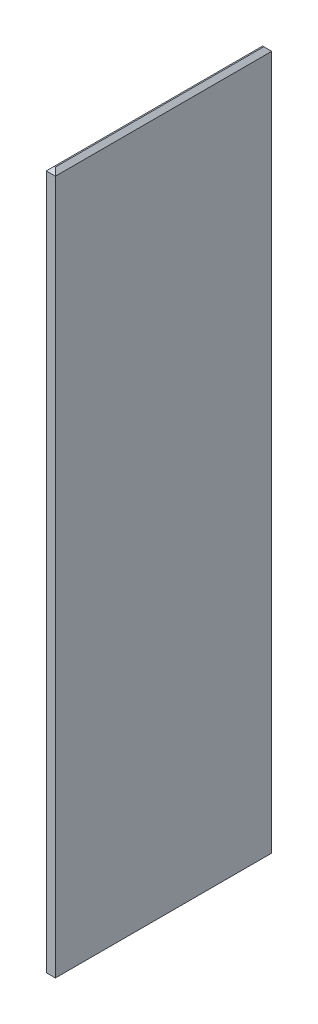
ISO-10303-21;
HEADER;
FILE_DESCRIPTION(('STEP AP214'),'2;1');
FILE_NAME('part.step','',(''),(''),'','','');
FILE_SCHEMA(('AUTOMOTIVE_DESIGN { 1 0 10303 214 1 1 1 1 }'));
ENDSEC;
DATA;
#1=APPLICATION_CONTEXT('core data for automotive mechanical design processes');
#2=APPLICATION_PROTOCOL_DEFINITION('international standard','automotive_design',2000,#1);
#3=PRODUCT_CONTEXT('',#1,'mechanical');
#4=PRODUCT('Part','Part','',(#3));
#5=PRODUCT_RELATED_PRODUCT_CATEGORY('part','',(#4));
#6=PRODUCT_DEFINITION_FORMATION('','',#4);
#7=PRODUCT_DEFINITION_CONTEXT('part definition',#1,'design');
#8=PRODUCT_DEFINITION('design','',#6,#7);
#9=PRODUCT_DEFINITION_SHAPE('','',#8);
#10=(LENGTH_UNIT() NAMED_UNIT(*) SI_UNIT(.MILLI.,.METRE.));
#11=(NAMED_UNIT(*) PLANE_ANGLE_UNIT() SI_UNIT($,.RADIAN.));
#12=(NAMED_UNIT(*) SI_UNIT($,.STERADIAN.) SOLID_ANGLE_UNIT());
#13=UNCERTAINTY_MEASURE_WITH_UNIT(LENGTH_MEASURE(1.E-05),#10,'distance_accuracy_value','');
#14=(GEOMETRIC_REPRESENTATION_CONTEXT(3) GLOBAL_UNCERTAINTY_ASSIGNED_CONTEXT((#13)) GLOBAL_UNIT_ASSIGNED_CONTEXT((#10,
#11,#12)) REPRESENTATION_CONTEXT('',''));
#15=CARTESIAN_POINT('',(0.,0.,0.));
#16=DIRECTION('',(0.,0.,1.));
#17=DIRECTION('',(1.,0.,0.));
#18=AXIS2_PLACEMENT_3D('',#15,#16,#17);
#19=CARTESIAN_POINT('',(-63.4999999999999,9739.6,1500.));
#20=DIRECTION('',(1.,0.,0.));
#21=DIRECTION('',(0.,0.,-1.));
#22=AXIS2_PLACEMENT_3D('',#19,#20,#21);
#23=PLANE('',#22);
#24=DIRECTION('',(0.,-1.,0.));
#25=VECTOR('',#24,1.);
#26=CARTESIAN_POINT('',(-63.5000000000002,9739.6,-1500.));
#27=LINE('',#26,#25);
#28=CARTESIAN_POINT('',(-63.5000000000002,9684.6,-1500.));
#29=VERTEX_POINT('',#28);
#30=CARTESIAN_POINT('',(-63.5000000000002,54.9999999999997,-1500.));
#31=VERTEX_POINT('',#30);
#32=EDGE_CURVE('E154',#29,#31,#27,.T.);
#33=ORIENTED_EDGE('',*,*,#32,.T.);
#34=DIRECTION('',(0.,0.,1.));
#35=VECTOR('',#34,1.);
#36=CARTESIAN_POINT('',(-63.4999999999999,54.9999999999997,1500.));
#37=LINE('',#36,#35);
#38=CARTESIAN_POINT('',(-63.4999999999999,54.9999999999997,1500.));
#39=VERTEX_POINT('',#38);
#40=EDGE_CURVE('E163',#31,#39,#37,.T.);
#41=ORIENTED_EDGE('',*,*,#40,.T.);
#42=DIRECTION('',(0.,-1.,0.));
#43=VECTOR('',#42,1.);
#44=CARTESIAN_POINT('',(-63.4999999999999,9739.6,1500.));
#45=LINE('',#44,#43);
#46=CARTESIAN_POINT('',(-63.4999999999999,9684.6,1500.));
#47=VERTEX_POINT('',#46);
#48=EDGE_CURVE('E133',#47,#39,#45,.T.);
#49=ORIENTED_EDGE('',*,*,#48,.F.);
#50=DIRECTION('',(0.,0.,-1.));
#51=VECTOR('',#50,1.);
#52=CARTESIAN_POINT('',(-63.5000000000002,9684.6,-1500.));
#53=LINE('',#52,#51);
#54=EDGE_CURVE('E167',#47,#29,#53,.T.);
#55=ORIENTED_EDGE('',*,*,#54,.T.);
#56=EDGE_LOOP('',(#33,#41,#49,#55));
#57=FACE_BOUND('',#56,.T.);
#58=ADVANCED_FACE('F44',(#57),#23,.F.);
#59=CARTESIAN_POINT('',(63.5000000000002,9739.6,1500.));
#60=DIRECTION('',(0.,0.,-1.));
#61=DIRECTION('',(-1.,0.,0.));
#62=AXIS2_PLACEMENT_3D('',#59,#60,#61);
#63=PLANE('',#62);
#64=ORIENTED_EDGE('',*,*,#48,.T.);
#65=DIRECTION('',(1.,0.,0.));
#66=VECTOR('',#65,1.);
#67=CARTESIAN_POINT('',(63.5000000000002,54.9999999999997,1500.));
#68=LINE('',#67,#66);
#69=CARTESIAN_POINT('',(63.5000000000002,54.9999999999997,1500.));
#70=VERTEX_POINT('',#69);
#71=EDGE_CURVE('E135',#39,#70,#68,.T.);
#72=ORIENTED_EDGE('',*,*,#71,.T.);
#73=DIRECTION('',(0.,-1.,0.));
#74=VECTOR('',#73,1.);
#75=CARTESIAN_POINT('',(63.5000000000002,9739.6,1500.));
#76=LINE('',#75,#74);
#77=CARTESIAN_POINT('',(63.5000000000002,9684.6,1500.));
#78=VERTEX_POINT('',#77);
#79=EDGE_CURVE('E113',#78,#70,#76,.T.);
#80=ORIENTED_EDGE('',*,*,#79,.F.);
#81=DIRECTION('',(-1.,0.,0.));
#82=VECTOR('',#81,1.);
#83=CARTESIAN_POINT('',(-63.4999999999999,9684.6,1500.));
#84=LINE('',#83,#82);
#85=EDGE_CURVE('E129',#78,#47,#84,.T.);
#86=ORIENTED_EDGE('',*,*,#85,.T.);
#87=EDGE_LOOP('',(#64,#72,#80,#86));
#88=FACE_BOUND('',#87,.T.);
#89=ADVANCED_FACE('F126',(#88),#63,.F.);
#90=CARTESIAN_POINT('',(63.5000000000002,9739.6,1500.));
#91=DIRECTION('',(-1.,0.,0.));
#92=DIRECTION('',(0.,0.,1.));
#93=AXIS2_PLACEMENT_3D('',#90,#91,#92);
#94=PLANE('',#93);
#95=ORIENTED_EDGE('',*,*,#79,.T.);
#96=DIRECTION('',(0.,0.,-1.));
#97=VECTOR('',#96,1.);
#98=CARTESIAN_POINT('',(63.5000000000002,54.9999999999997,1500.));
#99=LINE('',#98,#97);
#100=CARTESIAN_POINT('',(63.4999999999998,54.9999999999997,-1500.));
#101=VERTEX_POINT('',#100);
#102=EDGE_CURVE('E123',#70,#101,#99,.T.);
#103=ORIENTED_EDGE('',*,*,#102,.T.);
#104=DIRECTION('',(0.,-1.,0.));
#105=VECTOR('',#104,1.);
#106=CARTESIAN_POINT('',(63.4999999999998,9739.6,-1500.));
#107=LINE('',#106,#105);
#108=CARTESIAN_POINT('',(63.4999999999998,9684.6,-1500.));
#109=VERTEX_POINT('',#108);
#110=EDGE_CURVE('E120',#109,#101,#107,.T.);
#111=ORIENTED_EDGE('',*,*,#110,.F.);
#112=DIRECTION('',(0.,0.,1.));
#113=VECTOR('',#112,1.);
#114=CARTESIAN_POINT('',(63.5000000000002,9684.6,1500.));
#115=LINE('',#114,#113);
#116=EDGE_CURVE('E115',#109,#78,#115,.T.);
#117=ORIENTED_EDGE('',*,*,#116,.T.);
#118=EDGE_LOOP('',(#95,#103,#111,#117));
#119=FACE_BOUND('',#118,.T.);
#120=ADVANCED_FACE('F111',(#119),#94,.F.);
#121=CARTESIAN_POINT('',(63.4999999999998,9739.6,-1500.));
#122=DIRECTION('',(0.,0.,1.));
#123=DIRECTION('',(1.,0.,0.));
#124=AXIS2_PLACEMENT_3D('',#121,#122,#123);
#125=PLANE('',#124);
#126=ORIENTED_EDGE('',*,*,#110,.T.);
#127=DIRECTION('',(-1.,0.,0.));
#128=VECTOR('',#127,1.);
#129=CARTESIAN_POINT('',(63.4999999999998,54.9999999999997,-1500.));
#130=LINE('',#129,#128);
#131=EDGE_CURVE('E169',#101,#31,#130,.T.);
#132=ORIENTED_EDGE('',*,*,#131,.T.);
#133=ORIENTED_EDGE('',*,*,#32,.F.);
#134=DIRECTION('',(1.,0.,0.));
#135=VECTOR('',#134,1.);
#136=CARTESIAN_POINT('',(63.4999999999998,9684.6,-1500.));
#137=LINE('',#136,#135);
#138=EDGE_CURVE('E168',#29,#109,#137,.T.);
#139=ORIENTED_EDGE('',*,*,#138,.T.);
#140=EDGE_LOOP('',(#126,#132,#133,#139));
#141=FACE_BOUND('',#140,.T.);
#142=ADVANCED_FACE('F208',(#141),#125,.F.);
#143=CARTESIAN_POINT('',(0.,9739.6,0.));
#144=DIRECTION('',(0.,1.,0.));
#145=DIRECTION('',(0.,0.,1.));
#146=AXIS2_PLACEMENT_3D('',#143,#144,#145);
#147=PLANE('',#146);
#148=DIRECTION('',(0.,0.,-1.));
#149=VECTOR('',#148,1.);
#150=CARTESIAN_POINT('',(8.50000000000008,9739.6,-1500.));
#151=LINE('',#150,#149);
#152=CARTESIAN_POINT('',(8.50000000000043,9739.6,1445.));
#153=VERTEX_POINT('',#152);
#154=CARTESIAN_POINT('',(8.50000000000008,9739.6,-1445.));
#155=VERTEX_POINT('',#154);
#156=EDGE_CURVE('E54',#153,#155,#151,.T.);
#157=ORIENTED_EDGE('',*,*,#156,.T.);
#158=DIRECTION('',(-1.,0.,0.));
#159=VECTOR('',#158,1.);
#160=CARTESIAN_POINT('',(-63.5000000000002,9739.6,-1445.));
#161=LINE('',#160,#159);
#162=CARTESIAN_POINT('',(-8.50000000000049,9739.6,-1445.));
#163=VERTEX_POINT('',#162);
#164=EDGE_CURVE('E11',#155,#163,#161,.T.);
#165=ORIENTED_EDGE('',*,*,#164,.T.);
#166=DIRECTION('',(0.,0.,1.));
#167=VECTOR('',#166,1.);
#168=CARTESIAN_POINT('',(-8.50000000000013,9739.6,1500.));
#169=LINE('',#168,#167);
#170=CARTESIAN_POINT('',(-8.50000000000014,9739.6,1445.));
#171=VERTEX_POINT('',#170);
#172=EDGE_CURVE('E165',#163,#171,#169,.T.);
#173=ORIENTED_EDGE('',*,*,#172,.T.);
#174=DIRECTION('',(1.,0.,0.));
#175=VECTOR('',#174,1.);
#176=CARTESIAN_POINT('',(63.5000000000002,9739.6,1445.));
#177=LINE('',#176,#175);
#178=EDGE_CURVE('E68',#171,#153,#177,.T.);
#179=ORIENTED_EDGE('',*,*,#178,.T.);
#180=EDGE_LOOP('',(#157,#165,#173,#179));
#181=FACE_BOUND('',#180,.T.);
#182=ADVANCED_FACE('F212',(#181),#147,.T.);
#183=CARTESIAN_POINT('',(0.,0.,0.));
#184=DIRECTION('',(0.,1.,0.));
#185=DIRECTION('',(0.,0.,1.));
#186=AXIS2_PLACEMENT_3D('',#183,#184,#185);
#187=PLANE('',#186);
#188=DIRECTION('',(0.,0.,1.));
#189=VECTOR('',#188,1.);
#190=CARTESIAN_POINT('',(8.50000000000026,0.,0.));
#191=LINE('',#190,#189);
#192=CARTESIAN_POINT('',(8.50000000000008,0.,-1445.));
#193=VERTEX_POINT('',#192);
#194=CARTESIAN_POINT('',(8.50000000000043,0.,1445.));
#195=VERTEX_POINT('',#194);
#196=EDGE_CURVE('E171',#193,#195,#191,.T.);
#197=ORIENTED_EDGE('',*,*,#196,.T.);
#198=DIRECTION('',(-1.,0.,0.));
#199=VECTOR('',#198,1.);
#200=CARTESIAN_POINT('',(0.,0.,1445.));
#201=LINE('',#200,#199);
#202=CARTESIAN_POINT('',(-8.50000000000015,0.,1445.));
#203=VERTEX_POINT('',#202);
#204=EDGE_CURVE('E124',#195,#203,#201,.T.);
#205=ORIENTED_EDGE('',*,*,#204,.T.);
#206=DIRECTION('',(0.,0.,-1.));
#207=VECTOR('',#206,1.);
#208=CARTESIAN_POINT('',(-8.50000000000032,0.,0.));
#209=LINE('',#208,#207);
#210=CARTESIAN_POINT('',(-8.50000000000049,0.,-1445.));
#211=VERTEX_POINT('',#210);
#212=EDGE_CURVE('E180',#203,#211,#209,.T.);
#213=ORIENTED_EDGE('',*,*,#212,.T.);
#214=DIRECTION('',(1.,0.,0.));
#215=VECTOR('',#214,1.);
#216=CARTESIAN_POINT('',(0.,0.,-1445.));
#217=LINE('',#216,#215);
#218=EDGE_CURVE('E179',#211,#193,#217,.T.);
#219=ORIENTED_EDGE('',*,*,#218,.T.);
#220=EDGE_LOOP('',(#197,#205,#213,#219));
#221=FACE_BOUND('',#220,.T.);
#222=ADVANCED_FACE('F216',(#221),#187,.F.);
#223=CARTESIAN_POINT('',(63.4999999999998,54.9999999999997,-1500.));
#224=DIRECTION('',(0.,0.707106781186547,0.707106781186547));
#225=DIRECTION('',(-1.,0.,0.));
#226=AXIS2_PLACEMENT_3D('',#223,#224,#225);
#227=PLANE('',#226);
#228=DIRECTION('',(-0.577350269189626,-0.577350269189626,0.577350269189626));
#229=VECTOR('',#228,1.);
#230=CARTESIAN_POINT('',(63.4999999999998,54.9999999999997,-1500.));
#231=LINE('',#230,#229);
#232=EDGE_CURVE('E156',#193,#101,#231,.F.);
#233=ORIENTED_EDGE('',*,*,#232,.F.);
#234=ORIENTED_EDGE('',*,*,#218,.F.);
#235=DIRECTION('',(0.577350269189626,-0.577350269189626,0.577350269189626));
#236=VECTOR('',#235,1.);
#237=CARTESIAN_POINT('',(936.5,-945.,-500.));
#238=LINE('',#237,#236);
#239=EDGE_CURVE('E155',#31,#211,#238,.T.);
#240=ORIENTED_EDGE('',*,*,#239,.F.);
#241=ORIENTED_EDGE('',*,*,#131,.F.);
#242=EDGE_LOOP('',(#233,#234,#240,#241));
#243=FACE_BOUND('',#242,.T.);
#244=ADVANCED_FACE('F191',(#243),#227,.F.);
#245=CARTESIAN_POINT('',(-63.4999999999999,54.9999999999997,1500.));
#246=DIRECTION('',(0.707106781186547,0.707106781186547,0.));
#247=DIRECTION('',(0.,0.,1.));
#248=AXIS2_PLACEMENT_3D('',#245,#246,#247);
#249=PLANE('',#248);
#250=ORIENTED_EDGE('',*,*,#239,.T.);
#251=ORIENTED_EDGE('',*,*,#212,.F.);
#252=DIRECTION('',(-0.577350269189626,0.577350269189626,0.577350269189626));
#253=VECTOR('',#252,1.);
#254=CARTESIAN_POINT('',(-63.4999999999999,54.9999999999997,1500.));
#255=LINE('',#254,#253);
#256=EDGE_CURVE('E141',#39,#203,#255,.F.);
#257=ORIENTED_EDGE('',*,*,#256,.F.);
#258=ORIENTED_EDGE('',*,*,#40,.F.);
#259=EDGE_LOOP('',(#250,#251,#257,#258));
#260=FACE_BOUND('',#259,.T.);
#261=ADVANCED_FACE('F200',(#260),#249,.F.);
#262=CARTESIAN_POINT('',(63.5000000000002,54.9999999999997,1500.));
#263=DIRECTION('',(-0.707106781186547,0.707106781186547,0.));
#264=DIRECTION('',(0.,0.,-1.));
#265=AXIS2_PLACEMENT_3D('',#262,#263,#264);
#266=PLANE('',#265);
#267=ORIENTED_EDGE('',*,*,#232,.T.);
#268=ORIENTED_EDGE('',*,*,#102,.F.);
#269=DIRECTION('',(-0.577350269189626,-0.577350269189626,-0.577350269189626));
#270=VECTOR('',#269,1.);
#271=CARTESIAN_POINT('',(63.5000000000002,54.9999999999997,1500.));
#272=LINE('',#271,#270);
#273=EDGE_CURVE('E142',#195,#70,#272,.F.);
#274=ORIENTED_EDGE('',*,*,#273,.F.);
#275=ORIENTED_EDGE('',*,*,#196,.F.);
#276=EDGE_LOOP('',(#267,#268,#274,#275));
#277=FACE_BOUND('',#276,.T.);
#278=ADVANCED_FACE('F210',(#277),#266,.F.);
#279=CARTESIAN_POINT('',(63.5000000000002,54.9999999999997,1500.));
#280=DIRECTION('',(0.,0.707106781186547,-0.707106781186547));
#281=DIRECTION('',(1.,0.,0.));
#282=AXIS2_PLACEMENT_3D('',#279,#280,#281);
#283=PLANE('',#282);
#284=ORIENTED_EDGE('',*,*,#256,.T.);
#285=ORIENTED_EDGE('',*,*,#204,.F.);
#286=ORIENTED_EDGE('',*,*,#273,.T.);
#287=ORIENTED_EDGE('',*,*,#71,.F.);
#288=EDGE_LOOP('',(#284,#285,#286,#287));
#289=FACE_BOUND('',#288,.T.);
#290=ADVANCED_FACE('F205',(#289),#283,.F.);
#291=CARTESIAN_POINT('',(0.,9739.6,1445.));
#292=DIRECTION('',(0.,0.707106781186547,0.707106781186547));
#293=DIRECTION('',(-1.,0.,0.));
#294=AXIS2_PLACEMENT_3D('',#291,#292,#293);
#295=PLANE('',#294);
#296=DIRECTION('',(0.577350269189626,0.577350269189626,-0.577350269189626));
#297=VECTOR('',#296,1.);
#298=CARTESIAN_POINT('',(473.166666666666,10221.2666666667,963.333333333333));
#299=LINE('',#298,#297);
#300=EDGE_CURVE('E137',#47,#171,#299,.T.);
#301=ORIENTED_EDGE('',*,*,#300,.F.);
#302=ORIENTED_EDGE('',*,*,#85,.F.);
#303=DIRECTION('',(-0.577350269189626,0.577350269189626,-0.577350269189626));
#304=VECTOR('',#303,1.);
#305=CARTESIAN_POINT('',(5.66666666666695,9742.43333333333,1442.16666666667));
#306=LINE('',#305,#304);
#307=EDGE_CURVE('E49',#153,#78,#306,.F.);
#308=ORIENTED_EDGE('',*,*,#307,.F.);
#309=ORIENTED_EDGE('',*,*,#178,.F.);
#310=EDGE_LOOP('',(#301,#302,#308,#309));
#311=FACE_BOUND('',#310,.T.);
#312=ADVANCED_FACE('F48',(#311),#295,.T.);
#313=CARTESIAN_POINT('',(8.50000000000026,9739.6,0.));
#314=DIRECTION('',(0.707106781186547,0.707106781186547,0.));
#315=DIRECTION('',(0.,0.,1.));
#316=AXIS2_PLACEMENT_3D('',#313,#314,#315);
#317=PLANE('',#316);
#318=ORIENTED_EDGE('',*,*,#307,.T.);
#319=ORIENTED_EDGE('',*,*,#116,.F.);
#320=DIRECTION('',(-0.577350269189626,0.577350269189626,0.577350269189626));
#321=VECTOR('',#320,1.);
#322=CARTESIAN_POINT('',(-473.166666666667,10221.2666666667,-963.333333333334));
#323=LINE('',#322,#321);
#324=EDGE_CURVE('E144',#155,#109,#323,.F.);
#325=ORIENTED_EDGE('',*,*,#324,.F.);
#326=ORIENTED_EDGE('',*,*,#156,.F.);
#327=EDGE_LOOP('',(#318,#319,#325,#326));
#328=FACE_BOUND('',#327,.T.);
#329=ADVANCED_FACE('F143',(#328),#317,.T.);
#330=CARTESIAN_POINT('',(-8.50000000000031,9739.6,0.));
#331=DIRECTION('',(-0.707106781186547,0.707106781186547,0.));
#332=DIRECTION('',(0.,0.,-1.));
#333=AXIS2_PLACEMENT_3D('',#330,#331,#332);
#334=PLANE('',#333);
#335=ORIENTED_EDGE('',*,*,#300,.T.);
#336=ORIENTED_EDGE('',*,*,#172,.F.);
#337=DIRECTION('',(-0.577350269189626,-0.577350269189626,-0.577350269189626));
#338=VECTOR('',#337,1.);
#339=CARTESIAN_POINT('',(473.166666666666,10221.2666666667,-963.333333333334));
#340=LINE('',#339,#338);
#341=EDGE_CURVE('E146',#29,#163,#340,.F.);
#342=ORIENTED_EDGE('',*,*,#341,.F.);
#343=ORIENTED_EDGE('',*,*,#54,.F.);
#344=EDGE_LOOP('',(#335,#336,#342,#343));
#345=FACE_BOUND('',#344,.T.);
#346=ADVANCED_FACE('F213',(#345),#334,.T.);
#347=CARTESIAN_POINT('',(0.,9739.6,-1445.));
#348=DIRECTION('',(0.,0.707106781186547,-0.707106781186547));
#349=DIRECTION('',(1.,0.,0.));
#350=AXIS2_PLACEMENT_3D('',#347,#348,#349);
#351=PLANE('',#350);
#352=ORIENTED_EDGE('',*,*,#324,.T.);
#353=ORIENTED_EDGE('',*,*,#138,.F.);
#354=ORIENTED_EDGE('',*,*,#341,.T.);
#355=ORIENTED_EDGE('',*,*,#164,.F.);
#356=EDGE_LOOP('',(#352,#353,#354,#355));
#357=FACE_BOUND('',#356,.T.);
#358=ADVANCED_FACE('F211',(#357),#351,.T.);
#359=CLOSED_SHELL('',(#58,#89,#120,#142,#182,#222,#244,#261,#278,#290,#312,#329,#346,#358));
#360=MANIFOLD_SOLID_BREP('B2',#359);
#361=ADVANCED_BREP_SHAPE_REPRESENTATION('',(#18,#360),#14);
#362=SHAPE_DEFINITION_REPRESENTATION(#9,#361);
ENDSEC;
END-ISO-10303-21;
